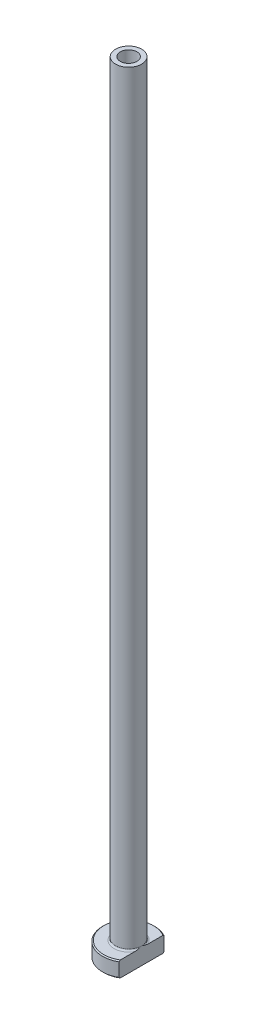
ISO-10303-21;
HEADER;
FILE_DESCRIPTION(('STEP AP214'),'2;1');
FILE_NAME('part.step','',(''),(''),'','','');
FILE_SCHEMA(('AUTOMOTIVE_DESIGN { 1 0 10303 214 1 1 1 1 }'));
ENDSEC;
DATA;
#1=APPLICATION_CONTEXT('core data for automotive mechanical design processes');
#2=APPLICATION_PROTOCOL_DEFINITION('international standard','automotive_design',2000,#1);
#3=PRODUCT_CONTEXT('',#1,'mechanical');
#4=PRODUCT('Part','Part','',(#3));
#5=PRODUCT_RELATED_PRODUCT_CATEGORY('part','',(#4));
#6=PRODUCT_DEFINITION_FORMATION('','',#4);
#7=PRODUCT_DEFINITION_CONTEXT('part definition',#1,'design');
#8=PRODUCT_DEFINITION('design','',#6,#7);
#9=PRODUCT_DEFINITION_SHAPE('','',#8);
#10=(LENGTH_UNIT() NAMED_UNIT(*) SI_UNIT(.MILLI.,.METRE.));
#11=(NAMED_UNIT(*) PLANE_ANGLE_UNIT() SI_UNIT($,.RADIAN.));
#12=(NAMED_UNIT(*) SI_UNIT($,.STERADIAN.) SOLID_ANGLE_UNIT());
#13=UNCERTAINTY_MEASURE_WITH_UNIT(LENGTH_MEASURE(1.E-05),#10,'distance_accuracy_value','');
#14=(GEOMETRIC_REPRESENTATION_CONTEXT(3) GLOBAL_UNCERTAINTY_ASSIGNED_CONTEXT((#13)) GLOBAL_UNIT_ASSIGNED_CONTEXT((#10,
#11,#12)) REPRESENTATION_CONTEXT('',''));
#15=CARTESIAN_POINT('',(0.,0.,0.));
#16=DIRECTION('',(0.,0.,1.));
#17=DIRECTION('',(1.,0.,0.));
#18=AXIS2_PLACEMENT_3D('',#15,#16,#17);
#19=CARTESIAN_POINT('',(0.,92.1876809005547,0.));
#20=DIRECTION('',(0.,1.,0.));
#21=DIRECTION('',(0.,0.,1.));
#22=AXIS2_PLACEMENT_3D('',#19,#20,#21);
#23=CYLINDRICAL_SURFACE('',#22,1.6);
#24=CARTESIAN_POINT('',(0.,150.,0.));
#25=DIRECTION('',(0.,1.,0.));
#26=DIRECTION('',(0.,0.,1.));
#27=AXIS2_PLACEMENT_3D('',#24,#25,#26);
#28=CIRCLE('',#27,1.6);
#29=CARTESIAN_POINT('',(0.,150.,1.6));
#30=VERTEX_POINT('',#29);
#31=EDGE_CURVE('E167',#30,#30,#28,.T.);
#32=ORIENTED_EDGE('',*,*,#31,.T.);
#33=EDGE_LOOP('',(#32));
#34=FACE_BOUND('',#33,.T.);
#35=CARTESIAN_POINT('',(0.,105.,0.));
#36=DIRECTION('',(0.,1.,0.));
#37=DIRECTION('',(0.,0.,1.));
#38=AXIS2_PLACEMENT_3D('',#35,#36,#37);
#39=CIRCLE('',#38,1.6);
#40=CARTESIAN_POINT('',(0.,105.,1.6));
#41=VERTEX_POINT('',#40);
#42=EDGE_CURVE('E170',#41,#41,#39,.T.);
#43=ORIENTED_EDGE('',*,*,#42,.F.);
#44=EDGE_LOOP('',(#43));
#45=FACE_BOUND('',#44,.T.);
#46=ADVANCED_FACE('F32',(#34,#45),#23,.F.);
#47=CARTESIAN_POINT('',(-1.6,150.,0.));
#48=DIRECTION('',(0.,1.,0.));
#49=DIRECTION('',(0.,0.,1.));
#50=AXIS2_PLACEMENT_3D('',#47,#48,#49);
#51=PLANE('',#50);
#52=CARTESIAN_POINT('',(0.,150.,0.));
#53=DIRECTION('',(0.,1.,0.));
#54=DIRECTION('',(0.,0.,1.));
#55=AXIS2_PLACEMENT_3D('',#52,#53,#54);
#56=CIRCLE('',#55,2.50000000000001);
#57=CARTESIAN_POINT('',(0.,150.,2.50000000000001));
#58=VERTEX_POINT('',#57);
#59=EDGE_CURVE('E174',#58,#58,#56,.T.);
#60=ORIENTED_EDGE('',*,*,#59,.T.);
#61=EDGE_LOOP('',(#60));
#62=FACE_BOUND('',#61,.T.);
#63=ORIENTED_EDGE('',*,*,#31,.F.);
#64=EDGE_LOOP('',(#63));
#65=FACE_BOUND('',#64,.T.);
#66=ADVANCED_FACE('F157',(#62,#65),#51,.T.);
#67=CARTESIAN_POINT('',(0.,92.1876809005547,0.));
#68=DIRECTION('',(0.,1.,0.));
#69=DIRECTION('',(0.,0.,1.));
#70=AXIS2_PLACEMENT_3D('',#67,#68,#69);
#71=CYLINDRICAL_SURFACE('',#70,2.5);
#72=CARTESIAN_POINT('',(0.,3.3,0.));
#73=DIRECTION('',(0.,1.,0.));
#74=DIRECTION('',(0.,0.,1.));
#75=AXIS2_PLACEMENT_3D('',#72,#73,#74);
#76=CIRCLE('',#75,2.5);
#77=CARTESIAN_POINT('',(2.5,3.3,0.));
#78=VERTEX_POINT('',#77);
#79=EDGE_CURVE('E180',#78,#78,#76,.T.);
#80=ORIENTED_EDGE('',*,*,#79,.T.);
#81=EDGE_LOOP('',(#80));
#82=FACE_BOUND('',#81,.T.);
#83=ORIENTED_EDGE('',*,*,#59,.F.);
#84=EDGE_LOOP('',(#83));
#85=FACE_BOUND('',#84,.T.);
#86=ADVANCED_FACE('F162',(#82,#85),#71,.T.);
#87=CARTESIAN_POINT('',(-2.49999999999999,3.,0.));
#88=DIRECTION('',(0.,1.,0.));
#89=DIRECTION('',(0.,0.,1.));
#90=AXIS2_PLACEMENT_3D('',#87,#88,#89);
#91=PLANE('',#90);
#92=DIRECTION('',(0.,0.,1.));
#93=VECTOR('',#92,1.);
#94=CARTESIAN_POINT('',(2.49999999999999,3.,0.));
#95=LINE('',#94,#93);
#96=CARTESIAN_POINT('',(2.49999999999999,3.,-4.09756024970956));
#97=VERTEX_POINT('',#96);
#98=CARTESIAN_POINT('',(2.49999999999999,3.,-1.26095202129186));
#99=VERTEX_POINT('',#98);
#100=EDGE_CURVE('E54',#97,#99,#95,.T.);
#101=ORIENTED_EDGE('',*,*,#100,.F.);
#102=CARTESIAN_POINT('',(0.,3.,0.));
#103=DIRECTION('',(0.,1.,0.));
#104=DIRECTION('',(0.,0.,1.));
#105=AXIS2_PLACEMENT_3D('',#102,#103,#104);
#106=CIRCLE('',#105,4.79999999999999);
#107=CARTESIAN_POINT('',(2.49999999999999,3.,4.09756024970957));
#108=VERTEX_POINT('',#107);
#109=EDGE_CURVE('E186',#97,#108,#106,.T.);
#110=ORIENTED_EDGE('',*,*,#109,.T.);
#111=CARTESIAN_POINT('',(2.49999999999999,3.,1.26095202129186));
#112=VERTEX_POINT('',#111);
#113=EDGE_CURVE('E134',#112,#108,#95,.T.);
#114=ORIENTED_EDGE('',*,*,#113,.F.);
#115=CARTESIAN_POINT('',(0.,3.,0.));
#116=DIRECTION('',(0.,1.,0.));
#117=DIRECTION('',(0.,0.,1.));
#118=AXIS2_PLACEMENT_3D('',#115,#116,#117);
#119=CIRCLE('',#118,2.8);
#120=EDGE_CURVE('E183',#112,#99,#119,.F.);
#121=ORIENTED_EDGE('',*,*,#120,.T.);
#122=EDGE_LOOP('',(#101,#110,#114,#121));
#123=FACE_BOUND('',#122,.T.);
#124=ADVANCED_FACE('F197',(#123),#91,.T.);
#125=CARTESIAN_POINT('',(0.,92.1876809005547,0.));
#126=DIRECTION('',(0.,1.,0.));
#127=DIRECTION('',(0.,0.,1.));
#128=AXIS2_PLACEMENT_3D('',#125,#126,#127);
#129=CYLINDRICAL_SURFACE('',#128,4.99999999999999);
#130=DIRECTION('',(0.,-1.,0.));
#131=VECTOR('',#130,1.);
#132=CARTESIAN_POINT('',(2.49999999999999,150.,4.33012701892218));
#133=LINE('',#132,#131);
#134=CARTESIAN_POINT('',(2.49999999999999,2.8,4.33012701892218));
#135=VERTEX_POINT('',#134);
#136=CARTESIAN_POINT('',(2.49999999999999,0.199999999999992,4.33012701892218));
#137=VERTEX_POINT('',#136);
#138=EDGE_CURVE('E82',#135,#137,#133,.T.);
#139=ORIENTED_EDGE('',*,*,#138,.F.);
#140=CARTESIAN_POINT('',(0.,2.8,0.));
#141=DIRECTION('',(0.,1.,0.));
#142=DIRECTION('',(0.,0.,1.));
#143=AXIS2_PLACEMENT_3D('',#140,#141,#142);
#144=CIRCLE('',#143,4.99999999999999);
#145=CARTESIAN_POINT('',(2.49999999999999,2.8,-4.33012701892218));
#146=VERTEX_POINT('',#145);
#147=EDGE_CURVE('E95',#135,#146,#144,.F.);
#148=ORIENTED_EDGE('',*,*,#147,.T.);
#149=DIRECTION('',(0.,-1.,0.));
#150=VECTOR('',#149,1.);
#151=CARTESIAN_POINT('',(2.49999999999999,150.,-4.33012701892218));
#152=LINE('',#151,#150);
#153=CARTESIAN_POINT('',(2.49999999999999,0.199999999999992,-4.33012701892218));
#154=VERTEX_POINT('',#153);
#155=EDGE_CURVE('E192',#146,#154,#152,.T.);
#156=ORIENTED_EDGE('',*,*,#155,.T.);
#157=CARTESIAN_POINT('',(0.,0.199999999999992,0.));
#158=DIRECTION('',(0.,-1.,0.));
#159=DIRECTION('',(0.,0.,-1.));
#160=AXIS2_PLACEMENT_3D('',#157,#158,#159);
#161=CIRCLE('',#160,4.99999999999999);
#162=EDGE_CURVE('E98',#154,#137,#161,.F.);
#163=ORIENTED_EDGE('',*,*,#162,.T.);
#164=EDGE_LOOP('',(#139,#148,#156,#163));
#165=FACE_BOUND('',#164,.T.);
#166=ADVANCED_FACE('F190',(#165),#129,.T.);
#167=CARTESIAN_POINT('',(-4.99999999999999,0.,0.));
#168=DIRECTION('',(0.,-1.,0.));
#169=DIRECTION('',(0.,0.,-1.));
#170=AXIS2_PLACEMENT_3D('',#167,#168,#169);
#171=PLANE('',#170);
#172=CARTESIAN_POINT('',(0.,0.,0.));
#173=DIRECTION('',(0.,-1.,0.));
#174=DIRECTION('',(0.,0.,-1.));
#175=AXIS2_PLACEMENT_3D('',#172,#173,#174);
#176=CIRCLE('',#175,2.34999999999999);
#177=CARTESIAN_POINT('',(0.,0.,-2.34999999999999));
#178=VERTEX_POINT('',#177);
#179=EDGE_CURVE('E40',#178,#178,#176,.F.);
#180=ORIENTED_EDGE('',*,*,#179,.T.);
#181=EDGE_LOOP('',(#180));
#182=FACE_BOUND('',#181,.T.);
#183=DIRECTION('',(0.,0.,-1.));
#184=VECTOR('',#183,1.);
#185=CARTESIAN_POINT('',(2.49999999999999,0.,4.33012701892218));
#186=LINE('',#185,#184);
#187=CARTESIAN_POINT('',(2.49999999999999,0.,4.09756024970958));
#188=VERTEX_POINT('',#187);
#189=CARTESIAN_POINT('',(2.49999999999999,0.,-4.09756024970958));
#190=VERTEX_POINT('',#189);
#191=EDGE_CURVE('E47',#188,#190,#186,.T.);
#192=ORIENTED_EDGE('',*,*,#191,.F.);
#193=CARTESIAN_POINT('',(0.,0.,0.));
#194=DIRECTION('',(0.,-1.,0.));
#195=DIRECTION('',(0.,0.,-1.));
#196=AXIS2_PLACEMENT_3D('',#193,#194,#195);
#197=CIRCLE('',#196,4.8);
#198=EDGE_CURVE('E92',#188,#190,#197,.T.);
#199=ORIENTED_EDGE('',*,*,#198,.T.);
#200=EDGE_LOOP('',(#192,#199));
#201=FACE_BOUND('',#200,.T.);
#202=ADVANCED_FACE('F91',(#182,#201),#171,.T.);
#203=CARTESIAN_POINT('',(0.,92.1876809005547,0.));
#204=DIRECTION('',(0.,1.,0.));
#205=DIRECTION('',(0.,0.,1.));
#206=AXIS2_PLACEMENT_3D('',#203,#204,#205);
#207=CYLINDRICAL_SURFACE('',#206,1.85);
#208=CARTESIAN_POINT('',(0.,0.5,0.));
#209=DIRECTION('',(0.,-1.,0.));
#210=DIRECTION('',(0.,0.,-1.));
#211=AXIS2_PLACEMENT_3D('',#208,#209,#210);
#212=CIRCLE('',#211,1.85);
#213=CARTESIAN_POINT('',(0.,0.5,-1.85));
#214=VERTEX_POINT('',#213);
#215=EDGE_CURVE('E11',#214,#214,#212,.T.);
#216=ORIENTED_EDGE('',*,*,#215,.T.);
#217=EDGE_LOOP('',(#216));
#218=FACE_BOUND('',#217,.T.);
#219=CARTESIAN_POINT('',(0.,93.,0.));
#220=DIRECTION('',(0.,1.,0.));
#221=DIRECTION('',(0.,0.,1.));
#222=AXIS2_PLACEMENT_3D('',#219,#220,#221);
#223=CIRCLE('',#222,1.85);
#224=CARTESIAN_POINT('',(0.,93.,1.85));
#225=VERTEX_POINT('',#224);
#226=EDGE_CURVE('E172',#225,#225,#223,.T.);
#227=ORIENTED_EDGE('',*,*,#226,.T.);
#228=EDGE_LOOP('',(#227));
#229=FACE_BOUND('',#228,.T.);
#230=ADVANCED_FACE('F215',(#218,#229),#207,.F.);
#231=CARTESIAN_POINT('',(0.,93.,0.));
#232=DIRECTION('',(0.,-1.,0.));
#233=DIRECTION('',(0.,0.,-1.));
#234=AXIS2_PLACEMENT_3D('',#231,#232,#233);
#235=CONICAL_SURFACE('',#234,1.85,0.0208303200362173);
#236=ORIENTED_EDGE('',*,*,#42,.T.);
#237=EDGE_LOOP('',(#236));
#238=FACE_BOUND('',#237,.T.);
#239=ORIENTED_EDGE('',*,*,#226,.F.);
#240=EDGE_LOOP('',(#239));
#241=FACE_BOUND('',#240,.T.);
#242=ADVANCED_FACE('F111',(#238,#241),#235,.F.);
#243=CARTESIAN_POINT('',(0.,3.3,0.));
#244=DIRECTION('',(0.,1.,0.));
#245=DIRECTION('',(0.,0.,1.));
#246=AXIS2_PLACEMENT_3D('',#243,#244,#245);
#247=TOROIDAL_SURFACE('',#246,2.8,0.3);
#248=ORIENTED_EDGE('',*,*,#120,.F.);
#249=CARTESIAN_POINT('',(2.5,3.3,0.));
#250=CARTESIAN_POINT('',(2.5,3.30000062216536,-4.84266322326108E-11));
#251=CARTESIAN_POINT('',(2.5,3.30000124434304,1.59621012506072E-07));
#252=CARTESIAN_POINT('',(2.5,3.30000243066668,6.45477867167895E-07));
#253=CARTESIAN_POINT('',(2.5,3.30000299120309,9.78480581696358E-07));
#254=CARTESIAN_POINT('',(2.5,3.3000041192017,1.77471963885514E-06));
#255=CARTESIAN_POINT('',(2.5,3.3000046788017,2.2490212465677E-06));
#256=CARTESIAN_POINT('',(2.5,3.30000572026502,3.25953658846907E-06));
#257=CARTESIAN_POINT('',(2.5,3.3000062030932,3.79480721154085E-06));
#258=CARTESIAN_POINT('',(2.5,3.3000078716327,5.75794604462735E-06));
#259=CARTESIAN_POINT('',(2.5,3.3000089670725,7.26424090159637E-06));
#260=CARTESIAN_POINT('',(2.5,3.30001087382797,1.03361127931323E-05));
#261=CARTESIAN_POINT('',(2.5,3.30001169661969,1.18949498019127E-05));
#262=CARTESIAN_POINT('',(2.5,3.30001489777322,1.81400850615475E-05));
#263=CARTESIAN_POINT('',(2.5,3.30001712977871,2.29062177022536E-05));
#264=CARTESIAN_POINT('',(2.5,3.30002067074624,3.21793866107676E-05));
#265=CARTESIAN_POINT('',(2.5,3.30002205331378,3.66588987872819E-05));
#266=CARTESIAN_POINT('',(2.49999999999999,3.30002810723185,5.61718403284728E-05));
#267=CARTESIAN_POINT('',(2.49999999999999,3.30003284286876,7.11735864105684E-05));
#268=CARTESIAN_POINT('',(2.49999999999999,3.30004025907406,9.89920326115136E-05));
#269=CARTESIAN_POINT('',(2.49999999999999,3.30004315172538,0.000111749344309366));
#270=CARTESIAN_POINT('',(2.49999999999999,3.30006652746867,0.00020624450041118));
#271=CARTESIAN_POINT('',(2.49999999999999,3.3000969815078,0.000285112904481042));
#272=CARTESIAN_POINT('',(2.49999999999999,3.30021213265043,0.000594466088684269));
#273=CARTESIAN_POINT('',(2.49999999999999,3.30028938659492,0.000826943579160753));
#274=CARTESIAN_POINT('',(2.49999999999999,3.30059681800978,0.00173885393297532));
#275=CARTESIAN_POINT('',(2.49999999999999,3.30083479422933,0.00241625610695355));
#276=CARTESIAN_POINT('',(2.49999999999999,3.30181198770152,0.00521069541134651));
#277=CARTESIAN_POINT('',(2.49999999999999,3.30254240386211,0.00732996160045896));
#278=CARTESIAN_POINT('',(2.49999999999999,3.31226043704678,0.0355096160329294));
#279=CARTESIAN_POINT('',(2.49999999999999,3.3213080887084,0.0615551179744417));
#280=CARTESIAN_POINT('',(2.49999999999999,3.3389621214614,0.11267798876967));
#281=CARTESIAN_POINT('',(2.49999999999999,3.34757212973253,0.137754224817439));
#282=CARTESIAN_POINT('',(2.49999999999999,3.36573068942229,0.190981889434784));
#283=CARTESIAN_POINT('',(2.49999999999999,3.37526654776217,0.219137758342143));
#284=CARTESIAN_POINT('',(2.49999999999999,3.39422867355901,0.275816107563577));
#285=CARTESIAN_POINT('',(2.49999999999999,3.40365272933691,0.304339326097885));
#286=CARTESIAN_POINT('',(2.49999999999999,3.42641697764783,0.374416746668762));
#287=CARTESIAN_POINT('',(2.49999999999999,3.43959811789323,0.416023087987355));
#288=CARTESIAN_POINT('',(2.49999999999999,3.46479157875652,0.498481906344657));
#289=CARTESIAN_POINT('',(2.49999999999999,3.47682455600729,0.539328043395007));
#290=CARTESIAN_POINT('',(2.49999999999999,3.5022442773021,0.629981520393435));
#291=CARTESIAN_POINT('',(2.49999999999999,3.51538048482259,0.679860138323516));
#292=CARTESIAN_POINT('',(2.49999999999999,3.53964074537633,0.78051176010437));
#293=CARTESIAN_POINT('',(2.49999999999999,3.55074877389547,0.83128867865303));
#294=CARTESIAN_POINT('',(2.49999999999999,3.57087054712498,0.937063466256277));
#295=CARTESIAN_POINT('',(2.49999999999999,3.57967623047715,0.992102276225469));
#296=CARTESIAN_POINT('',(2.49999999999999,3.59301148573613,1.1025602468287));
#297=CARTESIAN_POINT('',(2.49999999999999,3.59755297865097,1.1579779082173));
#298=CARTESIAN_POINT('',(2.49999999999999,3.60093314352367,1.26786705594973));
#299=CARTESIAN_POINT('',(2.49999999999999,3.59989366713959,1.32233291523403));
#300=CARTESIAN_POINT('',(2.49999999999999,3.59277279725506,1.40310062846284));
#301=CARTESIAN_POINT('',(2.49999999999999,3.58952137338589,1.42965222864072));
#302=CARTESIAN_POINT('',(2.49999999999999,3.5808585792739,1.48239078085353));
#303=CARTESIAN_POINT('',(2.49999999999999,3.57544928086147,1.50857805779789));
#304=CARTESIAN_POINT('',(2.49999999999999,3.56298810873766,1.55658799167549));
#305=CARTESIAN_POINT('',(2.49999999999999,3.55628200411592,1.57849902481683));
#306=CARTESIAN_POINT('',(2.49999999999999,3.54055393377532,1.62160292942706));
#307=CARTESIAN_POINT('',(2.49999999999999,3.53152220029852,1.64279233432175));
#308=CARTESIAN_POINT('',(2.49999999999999,3.51057199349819,1.68404469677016));
#309=CARTESIAN_POINT('',(2.49999999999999,3.49862012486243,1.70409105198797));
#310=CARTESIAN_POINT('',(2.49999999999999,3.47134074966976,1.74172093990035));
#311=CARTESIAN_POINT('',(2.49999999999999,3.45603127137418,1.75931683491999));
#312=CARTESIAN_POINT('',(2.49999999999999,3.42979930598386,1.78297070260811));
#313=CARTESIAN_POINT('',(2.49999999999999,3.42024268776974,1.79054141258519));
#314=CARTESIAN_POINT('',(2.49999999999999,3.40009035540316,1.80416997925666));
#315=CARTESIAN_POINT('',(2.49999999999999,3.38949499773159,1.81022835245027));
#316=CARTESIAN_POINT('',(2.49999999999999,3.36727740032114,1.82047087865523));
#317=CARTESIAN_POINT('',(2.49999999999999,3.35564531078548,1.82463409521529));
#318=CARTESIAN_POINT('',(2.49999999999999,3.33178837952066,1.83058442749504));
#319=CARTESIAN_POINT('',(2.49999999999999,3.31956435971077,1.83237474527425));
#320=CARTESIAN_POINT('',(2.49999999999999,3.29665736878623,1.83331852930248));
#321=CARTESIAN_POINT('',(2.49999999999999,3.28598670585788,1.83279233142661));
#322=CARTESIAN_POINT('',(2.49999999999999,3.26490749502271,1.82986307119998));
#323=CARTESIAN_POINT('',(2.49999999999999,3.25449899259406,1.82745968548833));
#324=CARTESIAN_POINT('',(2.49999999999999,3.23467098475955,1.82111257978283));
#325=CARTESIAN_POINT('',(2.49999999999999,3.225228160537,1.81724026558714));
#326=CARTESIAN_POINT('',(2.49999999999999,3.20699535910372,1.80819497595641));
#327=CARTESIAN_POINT('',(2.49999999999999,3.19820556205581,1.80302164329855));
#328=CARTESIAN_POINT('',(2.49999999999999,3.17663162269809,1.78842115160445));
#329=CARTESIAN_POINT('',(2.49999999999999,3.16436228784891,1.77823293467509));
#330=CARTESIAN_POINT('',(2.49999999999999,3.14157828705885,1.75604629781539));
#331=CARTESIAN_POINT('',(2.49999999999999,3.13106906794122,1.74404246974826));
#332=CARTESIAN_POINT('',(2.49999999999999,3.10600520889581,1.71142114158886));
#333=CARTESIAN_POINT('',(2.49999999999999,3.09267476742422,1.68986887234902));
#334=CARTESIAN_POINT('',(2.49999999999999,3.06940323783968,1.64508572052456));
#335=CARTESIAN_POINT('',(2.49999999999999,3.05946314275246,1.62185434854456));
#336=CARTESIAN_POINT('',(2.49999999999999,3.03545750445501,1.55546754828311));
#337=CARTESIAN_POINT('',(2.49999999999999,3.0244402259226,1.51122187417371));
#338=CARTESIAN_POINT('',(2.49999999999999,3.00863926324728,1.42119777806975));
#339=CARTESIAN_POINT('',(2.49999999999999,3.00393876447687,1.37540689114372));
#340=CARTESIAN_POINT('',(2.49999999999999,2.9992421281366,1.2807219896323));
#341=CARTESIAN_POINT('',(2.49999999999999,2.99956098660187,1.23181420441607));
#342=CARTESIAN_POINT('',(2.49999999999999,3.00436098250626,1.13410944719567));
#343=CARTESIAN_POINT('',(2.49999999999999,3.00885327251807,1.08531312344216));
#344=CARTESIAN_POINT('',(2.49999999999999,3.02074191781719,0.990773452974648));
#345=CARTESIAN_POINT('',(2.49999999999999,3.02796792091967,0.945007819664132));
#346=CARTESIAN_POINT('',(2.49999999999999,3.04465555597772,0.85419946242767));
#347=CARTESIAN_POINT('',(2.49999999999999,3.05410250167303,0.809153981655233));
#348=CARTESIAN_POINT('',(2.49999999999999,3.07710029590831,0.709411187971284));
#349=CARTESIAN_POINT('',(2.49999999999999,3.09109633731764,0.654817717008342));
#350=CARTESIAN_POINT('',(2.49999999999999,3.12140740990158,0.544863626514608));
#351=CARTESIAN_POINT('',(2.49999999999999,3.13777040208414,0.489516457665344));
#352=CARTESIAN_POINT('',(2.49999999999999,3.16649540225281,0.396740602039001));
#353=CARTESIAN_POINT('',(2.49999999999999,3.17848130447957,0.35919385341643));
#354=CARTESIAN_POINT('',(2.49999999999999,3.20280507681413,0.284651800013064));
#355=CARTESIAN_POINT('',(2.49999999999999,3.21513791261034,0.247654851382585));
#356=CARTESIAN_POINT('',(2.49999999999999,3.23873713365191,0.177767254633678));
#357=CARTESIAN_POINT('',(2.49999999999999,3.24997409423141,0.14486648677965));
#358=CARTESIAN_POINT('',(2.5,3.27307149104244,0.0777985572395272));
#359=CARTESIAN_POINT('',(2.5,3.28493883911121,0.0436336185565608));
#360=CARTESIAN_POINT('',(2.49999999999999,3.29745794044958,0.00732879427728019));
#361=CARTESIAN_POINT('',(2.49999999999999,3.29818879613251,0.00520838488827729));
#362=CARTESIAN_POINT('',(2.49999999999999,3.29916610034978,0.00241367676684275));
#363=CARTESIAN_POINT('',(2.5,3.29940376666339,0.00173715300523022));
#364=CARTESIAN_POINT('',(2.49999999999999,3.29971082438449,0.000826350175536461));
#365=CARTESIAN_POINT('',(2.49999999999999,3.29978800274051,0.000594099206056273));
#366=CARTESIAN_POINT('',(2.49999999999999,3.29990305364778,0.000285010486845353));
#367=CARTESIAN_POINT('',(2.49999999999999,3.29993349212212,0.00020618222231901));
#368=CARTESIAN_POINT('',(2.49999999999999,3.29995685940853,0.000111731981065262));
#369=CARTESIAN_POINT('',(2.49999999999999,3.2999597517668,9.89774316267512E-05));
#370=CARTESIAN_POINT('',(2.49999999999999,3.29996716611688,7.1165187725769E-05));
#371=CARTESIAN_POINT('',(2.5,3.29997189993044,5.61668089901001E-05));
#372=CARTESIAN_POINT('',(2.5,3.29997795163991,3.66576323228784E-05));
#373=CARTESIAN_POINT('',(2.5,3.29997933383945,3.21785239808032E-05));
#374=CARTESIAN_POINT('',(2.5,3.29998287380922,2.2906136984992E-05));
#375=CARTESIAN_POINT('',(2.5,3.29998510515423,1.81403656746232E-05));
#376=CARTESIAN_POINT('',(2.5,3.29998830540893,1.18955818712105E-05));
#377=CARTESIAN_POINT('',(2.5,3.2999891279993,1.03367758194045E-05));
#378=CARTESIAN_POINT('',(2.5,3.29999103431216,7.26492745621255E-06));
#379=CARTESIAN_POINT('',(2.5,3.29999212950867,5.75862244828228E-06));
#380=CARTESIAN_POINT('',(2.5,3.29999379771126,3.79542436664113E-06));
#381=CARTESIAN_POINT('',(2.5,3.2999942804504,3.26012730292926E-06));
#382=CARTESIAN_POINT('',(2.5,3.29999532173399,2.2495430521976E-06));
#383=CARTESIAN_POINT('',(2.5,3.29999588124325,1.77519869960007E-06));
#384=CARTESIAN_POINT('',(2.5,3.29999700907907,9.78856917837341E-07));
#385=CARTESIAN_POINT('',(2.5,3.29999756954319,6.45796915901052E-07));
#386=CARTESIAN_POINT('',(2.5,3.29999875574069,1.59799549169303E-07));
#387=CARTESIAN_POINT('',(2.5,3.29999937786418,4.84248337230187E-11));
#388=CARTESIAN_POINT('',(2.5,3.3,0.));
#389=B_SPLINE_CURVE_WITH_KNOTS('',3,(#249,#250,#251,#252,#253,#254,#255,#256,#257,#258,#259,
#260,#261,#262,#263,#264,#265,#266,#267,#268,#269,#270,#271,#272,#273,#274,#275,#276,#277,#278,
#279,#280,#281,#282,#283,#284,#285,#286,#287,#288,#289,#290,#291,#292,#293,#294,#295,#296,#297,
#298,#299,#300,#301,#302,#303,#304,#305,#306,#307,#308,#309,#310,#311,#312,#313,#314,#315,#316,
#317,#318,#319,#320,#321,#322,#323,#324,#325,#326,#327,#328,#329,#330,#331,#332,#333,#334,#335,
#336,#337,#338,#339,#340,#341,#342,#343,#344,#345,#346,#347,#348,#349,#350,#351,#352,#353,#354,
#355,#356,#357,#358,#359,#360,#361,#362,#363,#364,#365,#366,#367,#368,#369,#370,#371,#372,#373,
#374,#375,#376,#377,#378,#379,#380,#381,#382,#383,#384,#385,#386,#387,#388),.UNSPECIFIED.,.T.,
.F.,(4,2,2,2,2,2,2,2,2,2,2,2,2,2,2,2,2,2,2,2,2,2,2,2,2,2,2,2,2,2,2,2,2,2,2,2,2,2,2,2,2,2,2,2,2,
2,2,2,2,2,2,2,2,2,2,2,2,2,2,2,2,2,2,2,2,2,2,2,2,4),(0.,1.86789256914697E-06,
3.81549656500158E-06,6.00610528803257E-06,8.16653041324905E-06,1.37285598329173E-05,
1.90122181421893E-05,3.47597301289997E-05,4.8808263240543E-05,9.59978459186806E-05,
0.000135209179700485,0.000388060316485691,0.00112364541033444,0.00327678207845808,
0.010002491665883,0.0927120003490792,0.172253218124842,0.261432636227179,0.351551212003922,
0.482477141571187,0.610212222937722,0.764915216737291,0.920792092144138,1.08787897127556,
1.25449733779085,1.41749285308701,1.49767530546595,1.5777809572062,1.64642481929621,
1.71536183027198,1.78512750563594,1.85452737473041,1.89099315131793,1.92744645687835,
1.96429324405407,2.00109025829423,2.03297105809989,2.06485735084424,2.09535926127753,
2.12586955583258,2.17344034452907,2.2211557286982,2.29675134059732,2.37236907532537,
2.50839721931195,2.64619971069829,2.79268284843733,2.93955855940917,3.07848421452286,
3.21651583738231,3.38554045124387,3.55865938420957,3.6768964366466,3.79388863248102,
3.89819085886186,4.00668323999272,4.0134126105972,4.01556295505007,4.01629782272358,
4.01655054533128,4.01658974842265,4.01663692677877,4.01665097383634,4.01666671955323,
4.01667200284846,4.01667756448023,4.01667972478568,4.01668191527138,4.01668386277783,
4.01668573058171),.UNSPECIFIED.);
#390=EDGE_CURVE('E126',#112,#78,#389,.T.);
#391=ORIENTED_EDGE('',*,*,#390,.T.);
#392=ORIENTED_EDGE('',*,*,#79,.F.);
#393=CARTESIAN_POINT('',(2.5,3.3,0.));
#394=CARTESIAN_POINT('',(2.5,3.29999937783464,4.84271301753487E-11));
#395=CARTESIAN_POINT('',(2.5,3.29999875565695,-1.59621011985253E-07));
#396=CARTESIAN_POINT('',(2.5,3.29999756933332,-6.45477866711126E-07));
#397=CARTESIAN_POINT('',(2.5,3.2999970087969,-9.78480581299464E-07));
#398=CARTESIAN_POINT('',(2.5,3.29999588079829,-1.77471963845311E-06));
#399=CARTESIAN_POINT('',(2.5,3.29999532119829,-2.24902124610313E-06));
#400=CARTESIAN_POINT('',(2.5,3.29999427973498,-3.25953658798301E-06));
#401=CARTESIAN_POINT('',(2.5,3.29999379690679,-3.79480721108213E-06));
#402=CARTESIAN_POINT('',(2.5,3.2999921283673,-5.75794604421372E-06));
#403=CARTESIAN_POINT('',(2.5,3.29999103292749,-7.26424090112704E-06));
#404=CARTESIAN_POINT('',(2.5,3.29998912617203,-1.03361127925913E-05));
#405=CARTESIAN_POINT('',(2.5,3.2999883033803,-1.18949498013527E-05));
#406=CARTESIAN_POINT('',(2.5,3.29998510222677,-1.8140085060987E-05));
#407=CARTESIAN_POINT('',(2.5,3.29998287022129,-2.2906217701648E-05));
#408=CARTESIAN_POINT('',(2.5,3.29997932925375,-3.21793866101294E-05));
#409=CARTESIAN_POINT('',(2.5,3.29997794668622,-3.66588987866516E-05));
#410=CARTESIAN_POINT('',(2.49999999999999,3.29997189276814,-5.61718403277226E-05));
#411=CARTESIAN_POINT('',(2.49999999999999,3.29996715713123,-7.11735864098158E-05));
#412=CARTESIAN_POINT('',(2.49999999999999,3.29995974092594,-9.8992032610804E-05));
#413=CARTESIAN_POINT('',(2.49999999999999,3.29995684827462,-0.000111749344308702));
#414=CARTESIAN_POINT('',(2.49999999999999,3.29993347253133,-0.000206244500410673));
#415=CARTESIAN_POINT('',(2.49999999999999,3.29990301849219,-0.000285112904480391));
#416=CARTESIAN_POINT('',(2.49999999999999,3.29978786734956,-0.000594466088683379));
#417=CARTESIAN_POINT('',(2.49999999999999,3.29971061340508,-0.000826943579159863));
#418=CARTESIAN_POINT('',(2.49999999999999,3.29940318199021,-0.00173885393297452));
#419=CARTESIAN_POINT('',(2.49999999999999,3.29916520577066,-0.0024162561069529));
#420=CARTESIAN_POINT('',(2.49999999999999,3.29818801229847,-0.00521069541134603));
#421=CARTESIAN_POINT('',(2.49999999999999,3.29745759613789,-0.00732996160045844));
#422=CARTESIAN_POINT('',(2.49999999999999,3.28773956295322,-0.0355096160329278));
#423=CARTESIAN_POINT('',(2.49999999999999,3.2786919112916,-0.0615551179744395));
#424=CARTESIAN_POINT('',(2.49999999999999,3.2610378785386,-0.112677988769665));
#425=CARTESIAN_POINT('',(2.49999999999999,3.25242787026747,-0.137754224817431));
#426=CARTESIAN_POINT('',(2.49999999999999,3.2342693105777,-0.190981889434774));
#427=CARTESIAN_POINT('',(2.49999999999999,3.22473345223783,-0.219137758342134));
#428=CARTESIAN_POINT('',(2.49999999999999,3.20577132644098,-0.275816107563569));
#429=CARTESIAN_POINT('',(2.49999999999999,3.19634727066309,-0.304339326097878));
#430=CARTESIAN_POINT('',(2.49999999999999,3.17358302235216,-0.374416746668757));
#431=CARTESIAN_POINT('',(2.49999999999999,3.16040188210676,-0.416023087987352));
#432=CARTESIAN_POINT('',(2.49999999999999,3.13520842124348,-0.498481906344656));
#433=CARTESIAN_POINT('',(2.49999999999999,3.1231754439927,-0.539328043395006));
#434=CARTESIAN_POINT('',(2.49999999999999,3.0977557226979,-0.629981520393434));
#435=CARTESIAN_POINT('',(2.49999999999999,3.08461951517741,-0.679860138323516));
#436=CARTESIAN_POINT('',(2.49999999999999,3.06035925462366,-0.78051176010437));
#437=CARTESIAN_POINT('',(2.49999999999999,3.04925122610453,-0.83128867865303));
#438=CARTESIAN_POINT('',(2.49999999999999,3.02912945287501,-0.937063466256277));
#439=CARTESIAN_POINT('',(2.49999999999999,3.02032376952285,-0.992102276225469));
#440=CARTESIAN_POINT('',(2.49999999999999,3.00698851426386,-1.1025602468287));
#441=CARTESIAN_POINT('',(2.49999999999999,3.00244702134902,-1.1579779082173));
#442=CARTESIAN_POINT('',(2.49999999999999,2.99906685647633,-1.26786705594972));
#443=CARTESIAN_POINT('',(2.49999999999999,3.0001063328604,-1.32233291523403));
#444=CARTESIAN_POINT('',(2.49999999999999,3.00722720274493,-1.40310062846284));
#445=CARTESIAN_POINT('',(2.49999999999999,3.01047862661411,-1.42965222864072));
#446=CARTESIAN_POINT('',(2.49999999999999,3.01914142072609,-1.48239078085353));
#447=CARTESIAN_POINT('',(2.49999999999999,3.02455071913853,-1.50857805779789));
#448=CARTESIAN_POINT('',(2.49999999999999,3.03701189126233,-1.55658799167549));
#449=CARTESIAN_POINT('',(2.49999999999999,3.04371799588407,-1.57849902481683));
#450=CARTESIAN_POINT('',(2.49999999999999,3.05944606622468,-1.62160292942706));
#451=CARTESIAN_POINT('',(2.49999999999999,3.06847779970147,-1.64279233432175));
#452=CARTESIAN_POINT('',(2.49999999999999,3.08942800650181,-1.68404469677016));
#453=CARTESIAN_POINT('',(2.49999999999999,3.10137987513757,-1.70409105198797));
#454=CARTESIAN_POINT('',(2.49999999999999,3.12865925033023,-1.74172093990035));
#455=CARTESIAN_POINT('',(2.49999999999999,3.14396872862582,-1.75931683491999));
#456=CARTESIAN_POINT('',(2.49999999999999,3.17020069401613,-1.78297070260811));
#457=CARTESIAN_POINT('',(2.49999999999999,3.17975731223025,-1.79054141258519));
#458=CARTESIAN_POINT('',(2.49999999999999,3.19990964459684,-1.80416997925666));
#459=CARTESIAN_POINT('',(2.49999999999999,3.21050500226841,-1.81022835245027));
#460=CARTESIAN_POINT('',(2.49999999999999,3.23272259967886,-1.82047087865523));
#461=CARTESIAN_POINT('',(2.49999999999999,3.24435468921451,-1.82463409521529));
#462=CARTESIAN_POINT('',(2.49999999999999,3.26821162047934,-1.83058442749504));
#463=CARTESIAN_POINT('',(2.49999999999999,3.28043564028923,-1.83237474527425));
#464=CARTESIAN_POINT('',(2.49999999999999,3.30334263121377,-1.83331852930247));
#465=CARTESIAN_POINT('',(2.49999999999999,3.31401329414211,-1.83279233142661));
#466=CARTESIAN_POINT('',(2.49999999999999,3.33509250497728,-1.82986307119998));
#467=CARTESIAN_POINT('',(2.49999999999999,3.34550100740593,-1.82745968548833));
#468=CARTESIAN_POINT('',(2.49999999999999,3.36532901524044,-1.82111257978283));
#469=CARTESIAN_POINT('',(2.49999999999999,3.37477183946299,-1.81724026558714));
#470=CARTESIAN_POINT('',(2.49999999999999,3.39300464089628,-1.80819497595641));
#471=CARTESIAN_POINT('',(2.49999999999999,3.40179443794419,-1.80302164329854));
#472=CARTESIAN_POINT('',(2.49999999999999,3.42336837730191,-1.78842115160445));
#473=CARTESIAN_POINT('',(2.49999999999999,3.43563771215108,-1.77823293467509));
#474=CARTESIAN_POINT('',(2.49999999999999,3.45842171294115,-1.75604629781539));
#475=CARTESIAN_POINT('',(2.49999999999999,3.46893093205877,-1.74404246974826));
#476=CARTESIAN_POINT('',(2.49999999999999,3.49399479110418,-1.71142114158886));
#477=CARTESIAN_POINT('',(2.49999999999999,3.50732523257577,-1.68986887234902));
#478=CARTESIAN_POINT('',(2.49999999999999,3.53059676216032,-1.64508572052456));
#479=CARTESIAN_POINT('',(2.49999999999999,3.54053685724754,-1.62185434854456));
#480=CARTESIAN_POINT('',(2.49999999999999,3.56454249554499,-1.55546754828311));
#481=CARTESIAN_POINT('',(2.49999999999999,3.57555977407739,-1.51122187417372));
#482=CARTESIAN_POINT('',(2.49999999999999,3.59136073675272,-1.42119777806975));
#483=CARTESIAN_POINT('',(2.49999999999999,3.59606123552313,-1.37540689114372));
#484=CARTESIAN_POINT('',(2.49999999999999,3.6007578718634,-1.28072198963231));
#485=CARTESIAN_POINT('',(2.49999999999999,3.60043901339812,-1.23181420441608));
#486=CARTESIAN_POINT('',(2.49999999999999,3.59563901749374,-1.13410944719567));
#487=CARTESIAN_POINT('',(2.49999999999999,3.59114672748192,-1.08531312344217));
#488=CARTESIAN_POINT('',(2.49999999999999,3.5792580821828,-0.990773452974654));
#489=CARTESIAN_POINT('',(2.49999999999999,3.57203207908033,-0.945007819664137));
#490=CARTESIAN_POINT('',(2.49999999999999,3.55534444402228,-0.854199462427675));
#491=CARTESIAN_POINT('',(2.49999999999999,3.54589749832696,-0.809153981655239));
#492=CARTESIAN_POINT('',(2.49999999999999,3.52289970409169,-0.70941118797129));
#493=CARTESIAN_POINT('',(2.49999999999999,3.50890366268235,-0.654817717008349));
#494=CARTESIAN_POINT('',(2.49999999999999,3.47859259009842,-0.544863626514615));
#495=CARTESIAN_POINT('',(2.49999999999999,3.46222959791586,-0.48951645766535));
#496=CARTESIAN_POINT('',(2.49999999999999,3.43350459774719,-0.396740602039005));
#497=CARTESIAN_POINT('',(2.49999999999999,3.42151869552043,-0.359193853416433));
#498=CARTESIAN_POINT('',(2.49999999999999,3.39719492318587,-0.284651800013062));
#499=CARTESIAN_POINT('',(2.49999999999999,3.38486208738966,-0.247654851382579));
#500=CARTESIAN_POINT('',(2.5,3.36126286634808,-0.177767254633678));
#501=CARTESIAN_POINT('',(2.5,3.35002590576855,-0.144866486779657));
#502=CARTESIAN_POINT('',(2.49999999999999,3.32692850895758,-0.0777985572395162));
#503=CARTESIAN_POINT('',(2.49999999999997,3.31506116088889,-0.0436336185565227));
#504=CARTESIAN_POINT('',(2.5,3.30254205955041,-0.00732879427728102));
#505=CARTESIAN_POINT('',(2.5,3.30181120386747,-0.00520838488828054));
#506=CARTESIAN_POINT('',(2.49999999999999,3.30083389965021,-0.00241367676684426));
#507=CARTESIAN_POINT('',(2.49999999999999,3.30059623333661,-0.00173715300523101));
#508=CARTESIAN_POINT('',(2.5,3.3002891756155,-0.000826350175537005));
#509=CARTESIAN_POINT('',(2.5,3.30021199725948,-0.000594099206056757));
#510=CARTESIAN_POINT('',(2.49999999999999,3.30009694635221,-0.000285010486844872));
#511=CARTESIAN_POINT('',(2.49999999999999,3.30006650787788,-0.000206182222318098));
#512=CARTESIAN_POINT('',(2.49999999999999,3.30004314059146,-0.000111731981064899));
#513=CARTESIAN_POINT('',(2.5,3.30004024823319,-9.89774316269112E-05));
#514=CARTESIAN_POINT('',(2.5,3.30003283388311,-7.11651877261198E-05));
#515=CARTESIAN_POINT('',(2.5,3.30002810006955,-5.61668089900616E-05));
#516=CARTESIAN_POINT('',(2.5,3.30002204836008,-3.66576323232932E-05));
#517=CARTESIAN_POINT('',(2.5,3.30002066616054,-3.2178523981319E-05));
#518=CARTESIAN_POINT('',(2.5,3.30001712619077,-2.2906136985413E-05));
#519=CARTESIAN_POINT('',(2.5,3.30001489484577,-1.81403656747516E-05));
#520=CARTESIAN_POINT('',(2.5,3.30001169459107,-1.1895581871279E-05));
#521=CARTESIAN_POINT('',(2.5,3.30001087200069,-1.03367758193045E-05));
#522=CARTESIAN_POINT('',(2.5,3.30000896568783,-7.26492745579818E-06));
#523=CARTESIAN_POINT('',(2.5,3.30000787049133,-5.75862244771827E-06));
#524=CARTESIAN_POINT('',(2.5,3.30000620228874,-3.79542436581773E-06));
#525=CARTESIAN_POINT('',(2.5,3.3000057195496,-3.26012730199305E-06));
#526=CARTESIAN_POINT('',(2.5,3.300004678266,-2.24954305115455E-06));
#527=CARTESIAN_POINT('',(2.5,3.30000411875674,-1.77519869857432E-06));
#528=CARTESIAN_POINT('',(2.5,3.30000299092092,-9.7885691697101E-07));
#529=CARTESIAN_POINT('',(2.5,3.3000024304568,-6.45796915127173E-07));
#530=CARTESIAN_POINT('',(2.5,3.3000012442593,-1.59799548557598E-07));
#531=CARTESIAN_POINT('',(2.5,3.30000062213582,-4.84243301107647E-11));
#532=CARTESIAN_POINT('',(2.5,3.3,0.));
#533=B_SPLINE_CURVE_WITH_KNOTS('',3,(#393,#394,#395,#396,#397,#398,#399,#400,#401,#402,#403,
#404,#405,#406,#407,#408,#409,#410,#411,#412,#413,#414,#415,#416,#417,#418,#419,#420,#421,#422,
#423,#424,#425,#426,#427,#428,#429,#430,#431,#432,#433,#434,#435,#436,#437,#438,#439,#440,#441,
#442,#443,#444,#445,#446,#447,#448,#449,#450,#451,#452,#453,#454,#455,#456,#457,#458,#459,#460,
#461,#462,#463,#464,#465,#466,#467,#468,#469,#470,#471,#472,#473,#474,#475,#476,#477,#478,#479,
#480,#481,#482,#483,#484,#485,#486,#487,#488,#489,#490,#491,#492,#493,#494,#495,#496,#497,#498,
#499,#500,#501,#502,#503,#504,#505,#506,#507,#508,#509,#510,#511,#512,#513,#514,#515,#516,#517,
#518,#519,#520,#521,#522,#523,#524,#525,#526,#527,#528,#529,#530,#531,#532),.UNSPECIFIED.,.T.,
.F.,(4,2,2,2,2,2,2,2,2,2,2,2,2,2,2,2,2,2,2,2,2,2,2,2,2,2,2,2,2,2,2,2,2,2,2,2,2,2,2,2,2,2,2,2,2,
2,2,2,2,2,2,2,2,2,2,2,2,2,2,2,2,2,2,2,2,2,2,2,2,4),(0.,1.86789256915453E-06,
3.81549656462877E-06,6.00610528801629E-06,8.16653041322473E-06,1.37285598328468E-05,
1.90122181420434E-05,3.4759730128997E-05,4.88082632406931E-05,9.59978459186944E-05,
0.000135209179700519,0.000388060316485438,0.00112364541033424,0.00327678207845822,
0.010002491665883,0.092712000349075,0.172253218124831,0.261432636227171,0.351551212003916,
0.482477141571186,0.610212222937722,0.764915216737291,0.920792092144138,1.08787897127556,
1.25449733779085,1.41749285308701,1.49767530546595,1.5777809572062,1.64642481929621,
1.71536183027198,1.78512750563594,1.85452737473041,1.89099315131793,1.92744645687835,
1.96429324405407,2.00109025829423,2.03297105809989,2.06485735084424,2.09535926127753,
2.12586955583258,2.17344034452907,2.2211557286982,2.29675134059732,2.37236907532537,
2.50839721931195,2.64619971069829,2.79268284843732,2.93955855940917,3.07848421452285,
3.2165158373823,3.38554045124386,3.55865938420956,3.6768964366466,3.79388863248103,
3.89819085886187,4.00668323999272,4.0134126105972,4.01556295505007,4.01629782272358,
4.01655054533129,4.01658974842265,4.01663692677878,4.01665097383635,4.01666671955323,
4.01667200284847,4.01667756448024,4.01667972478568,4.01668191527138,4.01668386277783,
4.01668573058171),.UNSPECIFIED.);
#534=EDGE_CURVE('E135',#78,#99,#533,.T.);
#535=ORIENTED_EDGE('',*,*,#534,.T.);
#536=EDGE_LOOP('',(#248,#391,#392,#535));
#537=FACE_BOUND('',#536,.T.);
#538=ADVANCED_FACE('F141',(#537),#247,.F.);
#539=CARTESIAN_POINT('',(0.,3.,0.));
#540=DIRECTION('',(0.,-1.,0.));
#541=DIRECTION('',(0.,0.,-1.));
#542=AXIS2_PLACEMENT_3D('',#539,#540,#541);
#543=CONICAL_SURFACE('',#542,4.79999999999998,0.785398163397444);
#544=CARTESIAN_POINT('',(2.5,-2.05039133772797,-9.52786489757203));
#545=CARTESIAN_POINT('',(2.5,-1.84160367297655,-9.31199733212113));
#546=CARTESIAN_POINT('',(2.5,-1.6330400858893,-9.09591231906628));
#547=CARTESIAN_POINT('',(2.5,-1.21649358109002,-8.66317810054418));
#548=CARTESIAN_POINT('',(2.5,-1.00851067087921,-8.4465288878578));
#549=CARTESIAN_POINT('',(2.5,-0.593157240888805,-8.01243155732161));
#550=CARTESIAN_POINT('',(2.5,-0.385787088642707,-7.79498308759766));
#551=CARTESIAN_POINT('',(2.5,0.0280365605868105,-7.35921771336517));
#552=CARTESIAN_POINT('',(2.5,0.234490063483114,-7.14090081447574));
#553=CARTESIAN_POINT('',(2.5,0.642130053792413,-6.70748960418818));
#554=CARTESIAN_POINT('',(2.49999999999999,0.843339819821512,-6.4924172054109));
#555=CARTESIAN_POINT('',(2.49999999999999,1.24425381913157,-6.06087422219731));
#556=CARTESIAN_POINT('',(2.49999999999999,1.44395806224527,-5.84440364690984));
#557=CARTESIAN_POINT('',(2.49999999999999,1.84127751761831,-5.40963663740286));
#558=CARTESIAN_POINT('',(2.49999999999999,2.03889317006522,-5.19134060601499));
#559=CARTESIAN_POINT('',(2.49999999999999,2.43125043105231,-4.75218509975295));
#560=CARTESIAN_POINT('',(2.49999999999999,2.62599215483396,-4.5313257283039));
#561=CARTESIAN_POINT('',(2.49999999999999,2.93693788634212,-4.17181619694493));
#562=CARTESIAN_POINT('',(2.49999999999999,3.05446493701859,-4.03431188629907));
#563=CARTESIAN_POINT('',(2.49999999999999,3.28742704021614,-3.7575148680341));
#564=CARTESIAN_POINT('',(2.49999999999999,3.40286188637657,-3.61822198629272));
#565=CARTESIAN_POINT('',(2.49999999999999,3.63213234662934,-3.33586492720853));
#566=CARTESIAN_POINT('',(2.49999999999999,3.7459381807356,-3.19277645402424));
#567=CARTESIAN_POINT('',(2.49999999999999,3.96956266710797,-2.90356071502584));
#568=CARTESIAN_POINT('',(2.49999999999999,4.07938227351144,-2.75743418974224));
#569=CARTESIAN_POINT('',(2.49999999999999,4.29502410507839,-2.45881038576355));
#570=CARTESIAN_POINT('',(2.49999999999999,4.40076032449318,-2.30625006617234));
#571=CARTESIAN_POINT('',(2.49999999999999,4.5528694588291,-2.07299325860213));
#572=CARTESIAN_POINT('',(2.49999999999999,4.60252613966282,-1.9944419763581));
#573=CARTESIAN_POINT('',(2.49999999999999,4.69908164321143,-1.83566827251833));
#574=CARTESIAN_POINT('',(2.49999999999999,4.74598077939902,-1.75544604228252));
#575=CARTESIAN_POINT('',(2.49999999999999,4.83578466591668,-1.5940536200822));
#576=CARTESIAN_POINT('',(2.49999999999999,4.87873126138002,-1.51290702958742));
#577=CARTESIAN_POINT('',(2.49999999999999,4.96038600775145,-1.34852090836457));
#578=CARTESIAN_POINT('',(2.49999999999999,4.99909338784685,-1.26528100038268));
#579=CARTESIAN_POINT('',(2.49999999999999,5.10703093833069,-1.01251774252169));
#580=CARTESIAN_POINT('',(2.49999999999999,5.16843307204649,-0.839342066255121));
#581=CARTESIAN_POINT('',(2.49999999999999,5.23490554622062,-0.579703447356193));
#582=CARTESIAN_POINT('',(2.49999999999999,5.25253806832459,-0.496421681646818));
#583=CARTESIAN_POINT('',(2.49999999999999,5.27986337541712,-0.328535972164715));
#584=CARTESIAN_POINT('',(2.49999999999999,5.28955686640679,-0.243932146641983));
#585=CARTESIAN_POINT('',(2.49999999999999,5.30031768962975,-0.0744340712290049));
#586=CARTESIAN_POINT('',(2.49999999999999,5.30141176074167,0.01045845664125));
#587=CARTESIAN_POINT('',(2.49999999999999,5.29496530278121,0.179916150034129));
#588=CARTESIAN_POINT('',(2.49999999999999,5.28742406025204,0.264481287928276));
#589=CARTESIAN_POINT('',(2.49999999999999,5.2643342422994,0.431754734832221));
#590=CARTESIAN_POINT('',(2.49999999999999,5.24885436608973,0.514472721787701));
#591=CARTESIAN_POINT('',(2.49999999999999,5.21085318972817,0.678257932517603));
#592=CARTESIAN_POINT('',(2.49999999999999,5.18833104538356,0.759324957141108));
#593=CARTESIAN_POINT('',(2.49999999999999,5.1371892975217,0.92000107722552));
#594=CARTESIAN_POINT('',(2.49999999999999,5.10853534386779,0.999599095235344));
#595=CARTESIAN_POINT('',(2.49999999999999,5.04628092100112,1.1567927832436));
#596=CARTESIAN_POINT('',(2.49999999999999,5.01268146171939,1.23438885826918));
#597=CARTESIAN_POINT('',(2.49999999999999,4.90558195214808,1.46503672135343));
#598=CARTESIAN_POINT('',(2.49999999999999,4.82601567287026,1.61526350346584));
#599=CARTESIAN_POINT('',(2.49999999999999,4.65635232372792,1.90970759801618));
#600=CARTESIAN_POINT('',(2.49999999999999,4.56624199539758,2.0539170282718));
#601=CARTESIAN_POINT('',(2.49999999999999,4.37862201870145,2.33821627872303));
#602=CARTESIAN_POINT('',(2.49999999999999,4.28108460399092,2.47828761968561));
#603=CARTESIAN_POINT('',(2.49999999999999,4.08116271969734,2.75478641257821));
#604=CARTESIAN_POINT('',(2.49999999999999,3.97878070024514,2.89121565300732));
#605=CARTESIAN_POINT('',(2.49999999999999,3.76913910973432,3.16313520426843));
#606=CARTESIAN_POINT('',(2.49999999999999,3.6618330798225,3.29858952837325));
#607=CARTESIAN_POINT('',(2.49999999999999,3.44456217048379,3.56736427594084));
#608=CARTESIAN_POINT('',(2.49999999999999,3.33459700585,3.70068446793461));
#609=CARTESIAN_POINT('',(2.49999999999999,3.11293465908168,3.96532340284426));
#610=CARTESIAN_POINT('',(2.49999999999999,3.00124232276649,4.09664621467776));
#611=CARTESIAN_POINT('',(2.49999999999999,2.77631276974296,4.35796341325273));
#612=CARTESIAN_POINT('',(2.49999999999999,2.66307552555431,4.48795777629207));
#613=CARTESIAN_POINT('',(2.49999999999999,2.36028773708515,4.83228553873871));
#614=CARTESIAN_POINT('',(2.49999999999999,2.16967435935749,5.04568363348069));
#615=CARTESIAN_POINT('',(2.49999999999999,1.78611780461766,5.47037913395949));
#616=CARTESIAN_POINT('',(2.49999999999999,1.59317456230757,5.68167648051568));
#617=CARTESIAN_POINT('',(2.49999999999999,1.20540648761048,6.10290357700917));
#618=CARTESIAN_POINT('',(2.49999999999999,1.01058005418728,6.31283185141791));
#619=CARTESIAN_POINT('',(2.49999999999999,0.619649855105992,6.73149551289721));
#620=CARTESIAN_POINT('',(2.49999999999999,0.423546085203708,6.94023089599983));
#621=CARTESIAN_POINT('',(2.49999999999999,0.0384434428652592,7.34820392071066));
#622=CARTESIAN_POINT('',(2.49999999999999,-0.150515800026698,7.5474789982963));
#623=CARTESIAN_POINT('',(2.49999999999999,-0.529153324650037,7.94534601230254));
#624=CARTESIAN_POINT('',(2.49999999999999,-0.718831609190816,8.14393794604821));
#625=CARTESIAN_POINT('',(2.49999999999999,-1.09855461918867,8.54034636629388));
#626=CARTESIAN_POINT('',(2.49999999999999,-1.28859869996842,8.73816347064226));
#627=CARTESIAN_POINT('',(2.49999999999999,-1.66916268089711,9.13333639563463));
#628=CARTESIAN_POINT('',(2.49999999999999,-1.85968257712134,9.33069222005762));
#629=CARTESIAN_POINT('',(2.49999999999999,-2.05039133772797,9.52786489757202));
#630=B_SPLINE_CURVE_WITH_KNOTS('',3,(#544,#545,#546,#547,#548,#549,#550,#551,#552,#553,#554,
#555,#556,#557,#558,#559,#560,#561,#562,#563,#564,#565,#566,#567,#568,#569,#570,#571,#572,#573,
#574,#575,#576,#577,#578,#579,#580,#581,#582,#583,#584,#585,#586,#587,#588,#589,#590,#591,#592,
#593,#594,#595,#596,#597,#598,#599,#600,#601,#602,#603,#604,#605,#606,#607,#608,#609,#610,#611,
#612,#613,#614,#615,#616,#617,#618,#619,#620,#621,#622,#623,#624,#625,#626,#627,#628,#629),
.UNSPECIFIED.,.F.,.F.,(4,2,2,2,2,2,2,2,2,2,2,2,2,2,2,2,2,2,2,2,2,2,2,2,2,2,2,2,2,2,2,2,2,2,2,2,
2,2,2,2,2,2,4),(0.,0.900955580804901,1.80192274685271,2.70335062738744,3.6047726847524,
4.48832484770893,5.37187123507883,6.25522753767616,7.13854832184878,7.68119321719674,
8.22389134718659,8.77232299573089,9.32062249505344,9.87724663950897,10.1559936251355,
10.4347088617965,10.7100145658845,10.9853702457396,11.5339745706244,11.789046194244,
12.0440951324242,12.298350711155,12.5526272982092,12.8047396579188,13.0568822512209,
13.3104761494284,13.5640183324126,14.073261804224,14.5831526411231,15.0950533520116,
15.6066978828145,16.1250759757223,16.6435099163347,17.1606868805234,17.6778730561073,
18.5362451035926,19.394641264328,20.2538459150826,21.1130534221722,21.9369112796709,
22.7607723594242,23.5837145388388,24.4066499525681),.UNSPECIFIED.);
#631=EDGE_CURVE('E133',#146,#97,#630,.T.);
#632=ORIENTED_EDGE('',*,*,#631,.F.);
#633=ORIENTED_EDGE('',*,*,#147,.F.);
#634=EDGE_CURVE('E118',#108,#135,#630,.T.);
#635=ORIENTED_EDGE('',*,*,#634,.F.);
#636=ORIENTED_EDGE('',*,*,#109,.F.);
#637=EDGE_LOOP('',(#632,#633,#635,#636));
#638=FACE_BOUND('',#637,.T.);
#639=ADVANCED_FACE('F145',(#638),#543,.T.);
#640=CARTESIAN_POINT('',(0.,0.199999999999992,0.));
#641=DIRECTION('',(0.,1.,0.));
#642=DIRECTION('',(0.,0.,1.));
#643=AXIS2_PLACEMENT_3D('',#640,#641,#642);
#644=CONICAL_SURFACE('',#643,4.99999999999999,0.785398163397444);
#645=CARTESIAN_POINT('',(2.49999999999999,5.05039133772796,9.52786489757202));
#646=CARTESIAN_POINT('',(2.49999999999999,4.84160367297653,9.31199733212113));
#647=CARTESIAN_POINT('',(2.49999999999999,4.63304008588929,9.09591231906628));
#648=CARTESIAN_POINT('',(2.49999999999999,4.21649358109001,8.66317810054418));
#649=CARTESIAN_POINT('',(2.49999999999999,4.0085106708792,8.4465288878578));
#650=CARTESIAN_POINT('',(2.49999999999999,3.5931572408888,8.01243155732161));
#651=CARTESIAN_POINT('',(2.49999999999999,3.3857870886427,7.79498308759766));
#652=CARTESIAN_POINT('',(2.49999999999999,2.97196343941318,7.35921771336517));
#653=CARTESIAN_POINT('',(2.49999999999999,2.76550993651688,7.14090081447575));
#654=CARTESIAN_POINT('',(2.49999999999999,2.35786994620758,6.70748960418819));
#655=CARTESIAN_POINT('',(2.49999999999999,2.15666018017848,6.4924172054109));
#656=CARTESIAN_POINT('',(2.49999999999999,1.75574618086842,6.06087422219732));
#657=CARTESIAN_POINT('',(2.49999999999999,1.55604193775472,5.84440364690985));
#658=CARTESIAN_POINT('',(2.49999999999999,1.15872248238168,5.40963663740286));
#659=CARTESIAN_POINT('',(2.49999999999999,0.961106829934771,5.191340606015));
#660=CARTESIAN_POINT('',(2.49999999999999,0.568749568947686,4.75218509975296));
#661=CARTESIAN_POINT('',(2.49999999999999,0.374007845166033,4.53132572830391));
#662=CARTESIAN_POINT('',(2.49999999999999,0.0630621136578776,4.17181619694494));
#663=CARTESIAN_POINT('',(2.49999999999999,-0.0544649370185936,4.03431188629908));
#664=CARTESIAN_POINT('',(2.49999999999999,-0.287427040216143,3.75751486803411));
#665=CARTESIAN_POINT('',(2.49999999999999,-0.402861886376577,3.61822198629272));
#666=CARTESIAN_POINT('',(2.49999999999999,-0.632132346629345,3.33586492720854));
#667=CARTESIAN_POINT('',(2.49999999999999,-0.745938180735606,3.19277645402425));
#668=CARTESIAN_POINT('',(2.49999999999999,-0.969562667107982,2.90356071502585));
#669=CARTESIAN_POINT('',(2.49999999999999,-1.07938227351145,2.75743418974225));
#670=CARTESIAN_POINT('',(2.49999999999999,-1.2950241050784,2.45881038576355));
#671=CARTESIAN_POINT('',(2.49999999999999,-1.40076032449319,2.30625006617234));
#672=CARTESIAN_POINT('',(2.49999999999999,-1.55286945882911,2.07299325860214));
#673=CARTESIAN_POINT('',(2.49999999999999,-1.60252613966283,1.9944419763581));
#674=CARTESIAN_POINT('',(2.49999999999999,-1.69908164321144,1.83566827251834));
#675=CARTESIAN_POINT('',(2.49999999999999,-1.74598077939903,1.75544604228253));
#676=CARTESIAN_POINT('',(2.49999999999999,-1.83578466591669,1.5940536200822));
#677=CARTESIAN_POINT('',(2.49999999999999,-1.87873126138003,1.51290702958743));
#678=CARTESIAN_POINT('',(2.49999999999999,-1.96038600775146,1.34852090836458));
#679=CARTESIAN_POINT('',(2.49999999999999,-1.99909338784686,1.26528100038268));
#680=CARTESIAN_POINT('',(2.49999999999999,-2.1070309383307,1.01251774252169));
#681=CARTESIAN_POINT('',(2.49999999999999,-2.1684330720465,0.839342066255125));
#682=CARTESIAN_POINT('',(2.49999999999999,-2.23490554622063,0.579703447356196));
#683=CARTESIAN_POINT('',(2.49999999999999,-2.2525380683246,0.496421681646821));
#684=CARTESIAN_POINT('',(2.49999999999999,-2.27986337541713,0.328535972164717));
#685=CARTESIAN_POINT('',(2.49999999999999,-2.2895568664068,0.243932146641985));
#686=CARTESIAN_POINT('',(2.49999999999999,-2.30031768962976,0.0744340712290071));
#687=CARTESIAN_POINT('',(2.49999999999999,-2.30141176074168,-0.0104584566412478));
#688=CARTESIAN_POINT('',(2.49999999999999,-2.29496530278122,-0.179916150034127));
#689=CARTESIAN_POINT('',(2.49999999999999,-2.28742406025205,-0.264481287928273));
#690=CARTESIAN_POINT('',(2.49999999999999,-2.26433424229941,-0.431754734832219));
#691=CARTESIAN_POINT('',(2.49999999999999,-2.24885436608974,-0.514472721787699));
#692=CARTESIAN_POINT('',(2.49999999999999,-2.21085318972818,-0.6782579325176));
#693=CARTESIAN_POINT('',(2.49999999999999,-2.18833104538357,-0.759324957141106));
#694=CARTESIAN_POINT('',(2.49999999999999,-2.13718929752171,-0.920001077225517));
#695=CARTESIAN_POINT('',(2.49999999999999,-2.1085353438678,-0.999599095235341));
#696=CARTESIAN_POINT('',(2.49999999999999,-2.04628092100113,-1.15679278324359));
#697=CARTESIAN_POINT('',(2.49999999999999,-2.01268146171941,-1.23438885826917));
#698=CARTESIAN_POINT('',(2.49999999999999,-1.90558195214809,-1.46503672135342));
#699=CARTESIAN_POINT('',(2.49999999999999,-1.82601567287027,-1.61526350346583));
#700=CARTESIAN_POINT('',(2.49999999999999,-1.65635232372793,-1.90970759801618));
#701=CARTESIAN_POINT('',(2.49999999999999,-1.5662419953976,-2.0539170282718));
#702=CARTESIAN_POINT('',(2.49999999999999,-1.37862201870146,-2.33821627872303));
#703=CARTESIAN_POINT('',(2.49999999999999,-1.28108460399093,-2.47828761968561));
#704=CARTESIAN_POINT('',(2.49999999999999,-1.08116271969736,-2.75478641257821));
#705=CARTESIAN_POINT('',(2.49999999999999,-0.97878070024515,-2.89121565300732));
#706=CARTESIAN_POINT('',(2.49999999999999,-0.769139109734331,-3.16313520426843));
#707=CARTESIAN_POINT('',(2.49999999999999,-0.661833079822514,-3.29858952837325));
#708=CARTESIAN_POINT('',(2.49999999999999,-0.444562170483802,-3.56736427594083));
#709=CARTESIAN_POINT('',(2.49999999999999,-0.334597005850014,-3.70068446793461));
#710=CARTESIAN_POINT('',(2.49999999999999,-0.112934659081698,-3.96532340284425));
#711=CARTESIAN_POINT('',(2.49999999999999,-0.00124232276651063,-4.09664621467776));
#712=CARTESIAN_POINT('',(2.49999999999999,0.223687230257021,-4.35796341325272));
#713=CARTESIAN_POINT('',(2.49999999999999,0.336924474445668,-4.48795777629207));
#714=CARTESIAN_POINT('',(2.49999999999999,0.639712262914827,-4.8322855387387));
#715=CARTESIAN_POINT('',(2.49999999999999,0.830325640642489,-5.04568363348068));
#716=CARTESIAN_POINT('',(2.49999999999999,1.21388219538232,-5.47037913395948));
#717=CARTESIAN_POINT('',(2.49999999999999,1.40682543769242,-5.68167648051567));
#718=CARTESIAN_POINT('',(2.49999999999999,1.7945935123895,-6.10290357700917));
#719=CARTESIAN_POINT('',(2.5,1.98941994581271,-6.3128318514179));
#720=CARTESIAN_POINT('',(2.5,2.38035014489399,-6.73149551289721));
#721=CARTESIAN_POINT('',(2.5,2.57645391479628,-6.94023089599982));
#722=CARTESIAN_POINT('',(2.5,2.96155655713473,-7.34820392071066));
#723=CARTESIAN_POINT('',(2.5,3.15051580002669,-7.54747899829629));
#724=CARTESIAN_POINT('',(2.5,3.52915332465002,-7.94534601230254));
#725=CARTESIAN_POINT('',(2.5,3.7188316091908,-8.14393794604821));
#726=CARTESIAN_POINT('',(2.5,4.09855461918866,-8.54034636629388));
#727=CARTESIAN_POINT('',(2.5,4.28859869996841,-8.73816347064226));
#728=CARTESIAN_POINT('',(2.5,4.6691626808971,-9.13333639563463));
#729=CARTESIAN_POINT('',(2.5,4.85968257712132,-9.33069222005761));
#730=CARTESIAN_POINT('',(2.5,5.05039133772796,-9.52786489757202));
#731=B_SPLINE_CURVE_WITH_KNOTS('',3,(#645,#646,#647,#648,#649,#650,#651,#652,#653,#654,#655,
#656,#657,#658,#659,#660,#661,#662,#663,#664,#665,#666,#667,#668,#669,#670,#671,#672,#673,#674,
#675,#676,#677,#678,#679,#680,#681,#682,#683,#684,#685,#686,#687,#688,#689,#690,#691,#692,#693,
#694,#695,#696,#697,#698,#699,#700,#701,#702,#703,#704,#705,#706,#707,#708,#709,#710,#711,#712,
#713,#714,#715,#716,#717,#718,#719,#720,#721,#722,#723,#724,#725,#726,#727,#728,#729,#730),
.UNSPECIFIED.,.F.,.F.,(4,2,2,2,2,2,2,2,2,2,2,2,2,2,2,2,2,2,2,2,2,2,2,2,2,2,2,2,2,2,2,2,2,2,2,2,
2,2,2,2,2,2,4),(0.,0.900955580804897,1.80192274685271,2.70335062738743,3.60477268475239,
4.48832484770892,5.37187123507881,6.25522753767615,7.13854832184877,7.68119321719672,
8.22389134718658,8.77232299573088,9.32062249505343,9.87724663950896,10.1559936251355,
10.4347088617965,10.7100145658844,10.9853702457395,11.5339745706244,11.789046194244,
12.0440951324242,12.298350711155,12.5526272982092,12.8047396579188,13.0568822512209,
13.3104761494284,13.5640183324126,14.0732618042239,14.583152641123,15.0950533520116,
15.6066978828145,16.1250759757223,16.6435099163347,17.1606868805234,17.6778730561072,
18.5362451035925,19.394641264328,20.2538459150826,21.1130534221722,21.9369112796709,
22.7607723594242,23.5837145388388,24.4066499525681),.UNSPECIFIED.);
#732=EDGE_CURVE('E79',#137,#188,#731,.T.);
#733=ORIENTED_EDGE('',*,*,#732,.F.);
#734=ORIENTED_EDGE('',*,*,#162,.F.);
#735=EDGE_CURVE('E87',#190,#154,#731,.T.);
#736=ORIENTED_EDGE('',*,*,#735,.F.);
#737=ORIENTED_EDGE('',*,*,#198,.F.);
#738=EDGE_LOOP('',(#733,#734,#736,#737));
#739=FACE_BOUND('',#738,.T.);
#740=ADVANCED_FACE('F94',(#739),#644,.T.);
#741=CARTESIAN_POINT('',(2.49999999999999,150.,4.33012701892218));
#742=DIRECTION('',(-1.,0.,0.));
#743=DIRECTION('',(0.,0.,1.));
#744=AXIS2_PLACEMENT_3D('',#741,#742,#743);
#745=PLANE('',#744);
#746=ORIENTED_EDGE('',*,*,#390,.F.);
#747=ORIENTED_EDGE('',*,*,#113,.T.);
#748=ORIENTED_EDGE('',*,*,#634,.T.);
#749=ORIENTED_EDGE('',*,*,#138,.T.);
#750=ORIENTED_EDGE('',*,*,#732,.T.);
#751=ORIENTED_EDGE('',*,*,#191,.T.);
#752=ORIENTED_EDGE('',*,*,#735,.T.);
#753=ORIENTED_EDGE('',*,*,#155,.F.);
#754=ORIENTED_EDGE('',*,*,#631,.T.);
#755=ORIENTED_EDGE('',*,*,#100,.T.);
#756=ORIENTED_EDGE('',*,*,#534,.F.);
#757=EDGE_LOOP('',(#746,#747,#748,#749,#750,#751,#752,#753,#754,#755,#756));
#758=FACE_BOUND('',#757,.T.);
#759=ADVANCED_FACE('F80',(#758),#745,.F.);
#760=CARTESIAN_POINT('',(0.,0.,0.));
#761=DIRECTION('',(0.,-1.,0.));
#762=DIRECTION('',(0.,0.,-1.));
#763=AXIS2_PLACEMENT_3D('',#760,#761,#762);
#764=CONICAL_SURFACE('',#763,2.34999999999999,0.785398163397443);
#765=ORIENTED_EDGE('',*,*,#215,.F.);
#766=EDGE_LOOP('',(#765));
#767=FACE_BOUND('',#766,.T.);
#768=ORIENTED_EDGE('',*,*,#179,.F.);
#769=EDGE_LOOP('',(#768));
#770=FACE_BOUND('',#769,.T.);
#771=ADVANCED_FACE('F34',(#767,#770),#764,.F.);
#772=CLOSED_SHELL('',(#46,#66,#86,#124,#166,#202,#230,#242,#538,#639,#740,#759,#771));
#773=MANIFOLD_SOLID_BREP('B2',#772);
#774=ADVANCED_BREP_SHAPE_REPRESENTATION('',(#18,#773),#14);
#775=SHAPE_DEFINITION_REPRESENTATION(#9,#774);
ENDSEC;
END-ISO-10303-21;
